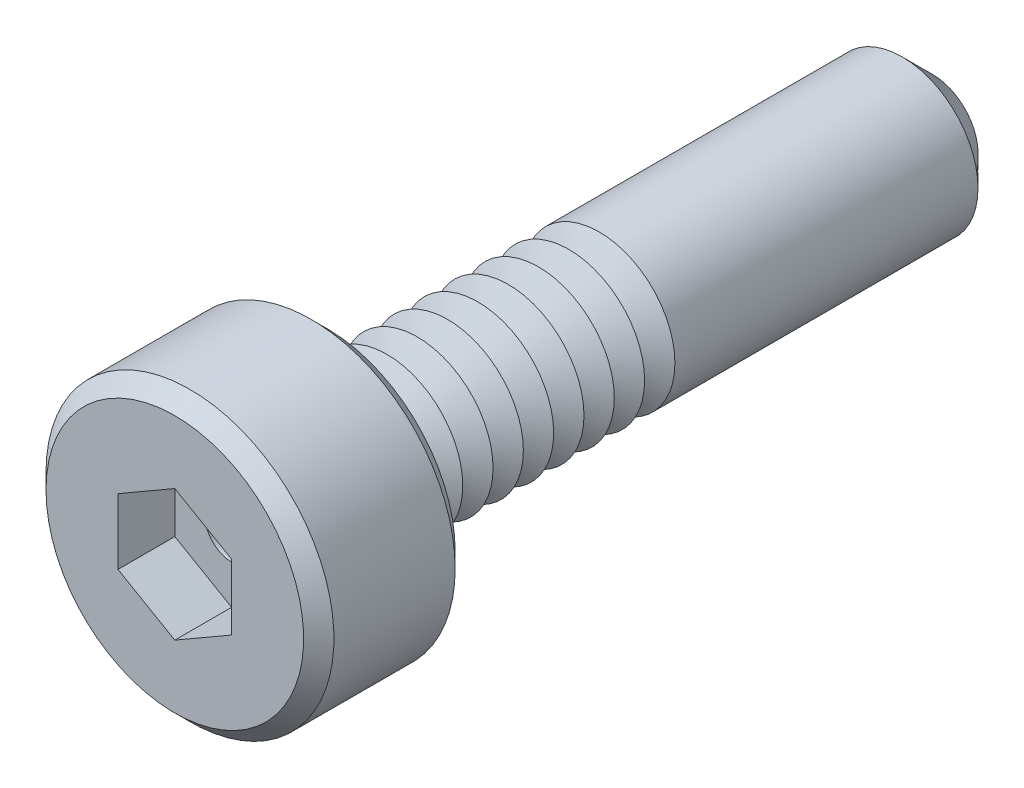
from build123d import *

# Parameters (mm, degrees)
SKETCH1_R           = 1.9
BOSS_EXTRUDE1_DEPTH = 2
SKETCH2_R           = 1
BOSS_EXTRUDE2_DEPTH = 8
CHAMFER1_SIZE       = 0.4
LPATTERN1_COUNT     = 9
LPATTERN1_PITCH     = 0.4
CUT_EXTRUDE1_DEPTH  = 0.75
SKETCH6_R           = 0.35
CUT_EXTRUDE2_DEPTH  = 9.25
CHAMFER2_SIZE       = 0.2


with BuildPart() as part:
    # Sketch1 → Boss-Extrude1 (new body)
    with BuildSketch(Plane.XY):
        Circle(SKETCH1_R)
    extrude(amount=BOSS_EXTRUDE1_DEPTH)

    # Sketch2 → Boss-Extrude2 (add)
    with BuildSketch(Plane(origin=(0, 0, 0), x_dir=(-1, 0, 0), z_dir=(0, 0, -1))):
        Circle(SKETCH2_R)
    extrude(amount=BOSS_EXTRUDE2_DEPTH)

    # Chamfer1
    chamfer1_edges = [part.edges().sort_by_distance(p)[0] for p in [
        (1, 0, -8),
    ]]
    chamfer(chamfer1_edges, length=CHAMFER1_SIZE)

    # Sketch4 → Cut-Revolve1 (revolve, cut)
    with BuildSketch(Plane(origin=(0, 0, 0), x_dir=(0, 0, -1), z_dir=(1, 0, 0)), mode=Mode.PRIVATE) as cut_revolve1_sk:
        Polygon((0, 1), (0.2, 0.653589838), (0.4, 1), align=None)
    cut_revolve1 = revolve(cut_revolve1_sk.sketch.rotate(Axis((0, 0, 2.512122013), (0, 0, -1)), 90), axis=Axis((0, 0, 2.512122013), (0, 0, -1)), mode=Mode.SUBTRACT)

    # LPattern1: Cut-Revolve1 ×9
    with Locations(*[(0, 0, -i * LPATTERN1_PITCH) for i in range(1, LPATTERN1_COUNT)]):
        add(cut_revolve1, mode=Mode.SUBTRACT)

    # Sketch5 → Cut-Extrude1 (cut)
    with BuildSketch(Plane.XY.offset(2)):
        Polygon((0, 0.866025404), (-0.75, 0.433012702), (-0.75, -0.433012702), (0, -0.866025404), (0.75, -0.433012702), (0.75, 0.433012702), align=None)
    extrude(amount=-CUT_EXTRUDE1_DEPTH, mode=Mode.SUBTRACT)

    # Sketch6 → Cut-Extrude2 (cut)
    with BuildSketch(Plane.XY.offset(1.25)):
        Circle(SKETCH6_R)
    extrude(amount=-CUT_EXTRUDE2_DEPTH, mode=Mode.SUBTRACT)

    # Chamfer2
    chamfer2_edges = [part.edges().sort_by_distance(p)[0] for p in [
        (-1.9, 0, 0),
        (-1.9, 0, 2),
    ]]
    chamfer(chamfer2_edges, length=CHAMFER2_SIZE)


solid = part.part
